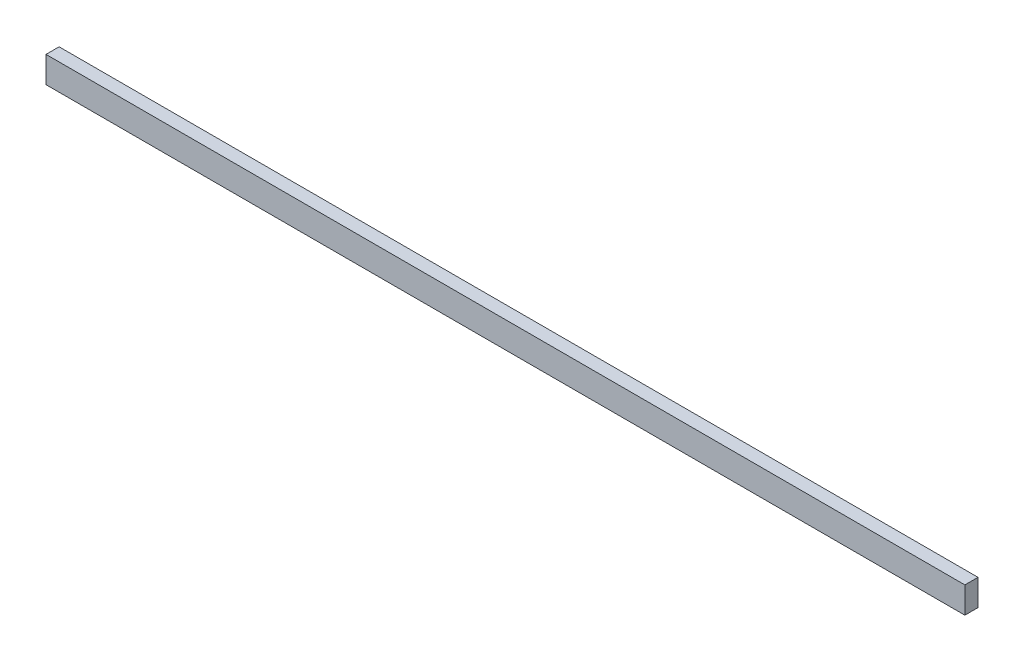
from build123d import *

# Parameters (mm, degrees)
ESQUISSE1_W      = 350
ESQUISSE1_H      = 10
EXTRUSION1_DEPTH = 5


with BuildPart() as part:
    # Esquisse1 → Extrusion1 (new body)
    with BuildSketch(Plane.XY):
        with Locations((175, 5)):
            Rectangle(ESQUISSE1_W, ESQUISSE1_H)
    extrude(amount=EXTRUSION1_DEPTH)


solid = part.part
